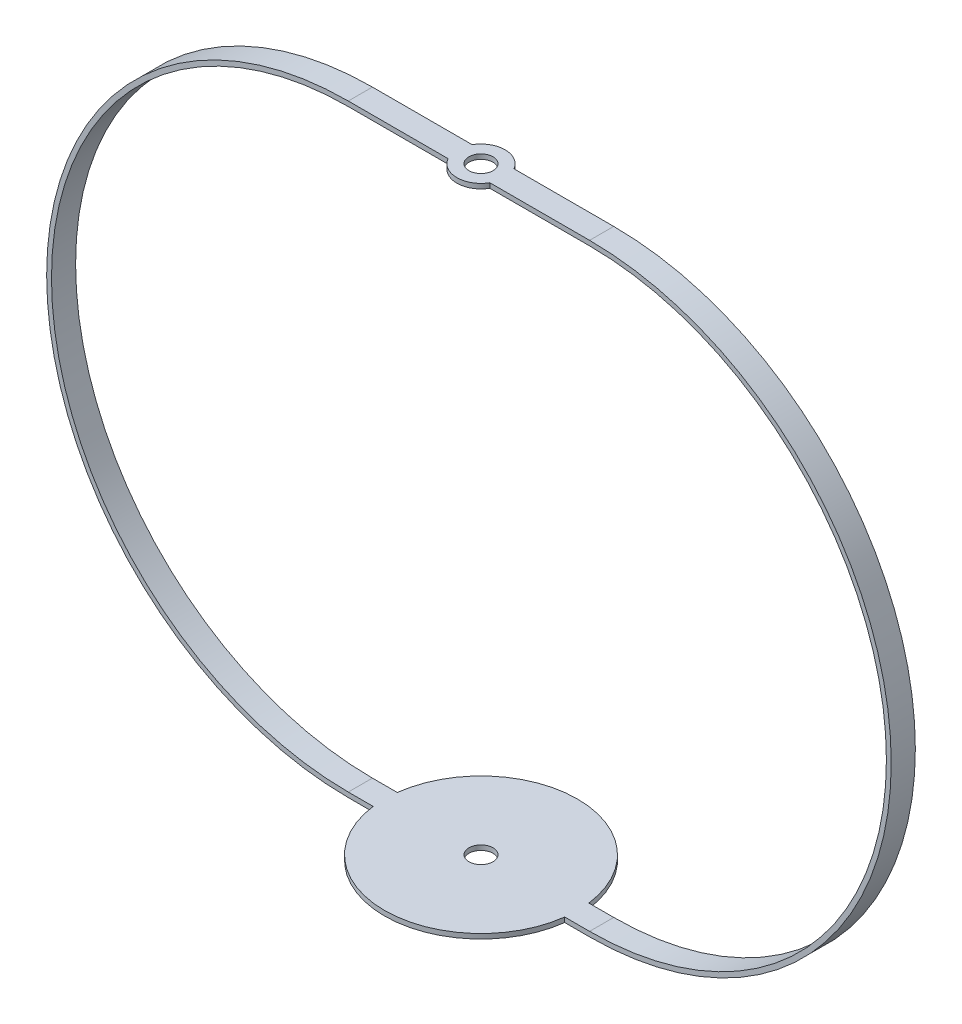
from build123d import *

# Parameters (mm, degrees)
AUFSATZ_LINEAR_AUSTRAGEN2_DEPTH      = 5
AUFSATZ_LINEAR_AUSTRAGEN2_DEPTH_BACK = 5
SKIZZE8_R                            = 10
AUFSATZ_LINEAR_AUSTRAGEN3_DEPTH      = 2
SKIZZE10_R                           = 40
AUFSATZ_LINEAR_AUSTRAGEN4_DEPTH      = 2
SKIZZE9_R                            = 5
SCHNITT_LINEAR_AUSTRAGEN3_DEPTH      = 336.394602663


with BuildPart() as part:
    # Skizze1 → Aufsatz-Linear austragen2 (new, two sides: drawn at the far end of the back side and taken through both)
    with BuildSketch(Plane.XY.offset(-AUFSATZ_LINEAR_AUSTRAGEN2_DEPTH_BACK)):
        with BuildLine():
            Line((-5.023775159, 250), (94.976224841, 250))
            ThreePointArc((94.976224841, 250), (219.976224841, 125), (94.976224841, 0))
            Line((94.976224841, 0), (-5.023775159, 0))
            ThreePointArc((-5.023775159, 0), (-130.023775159, 125), (-5.023775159, 250))
        make_face()
        with BuildLine():
            Line((94.976224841, 248), (-5.023775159, 248))
            ThreePointArc((-5.023775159, 248), (-128.023775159, 125), (-5.023775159, 2))
            Line((-5.023775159, 2), (94.976224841, 2))
            ThreePointArc((94.976224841, 2), (217.976224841, 125), (94.976224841, 248))
        make_face(mode=Mode.SUBTRACT)
    extrude(amount=AUFSATZ_LINEAR_AUSTRAGEN2_DEPTH + AUFSATZ_LINEAR_AUSTRAGEN2_DEPTH_BACK)

    # Skizze8 → Aufsatz-Linear austragen3 (add)
    with BuildSketch(Plane(origin=(0, 250, 0), x_dir=(1, 0, 0), z_dir=(0, 1, 0))):
        with Locations((44.976224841, 0)):
            Circle(SKIZZE8_R)
    extrude(amount=-AUFSATZ_LINEAR_AUSTRAGEN3_DEPTH)

    # Skizze10 → Aufsatz-Linear austragen4 (add)
    with BuildSketch(Plane(origin=(0, 2, 0), x_dir=(1, 0, 0), z_dir=(0, 1, 0))):
        with Locations((44.976224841, 0)):
            Circle(SKIZZE10_R)
    extrude(amount=-AUFSATZ_LINEAR_AUSTRAGEN4_DEPTH)

    # Skizze9 → Schnitt-Linear austragen3 (cut, through all)
    with BuildSketch(Plane(origin=(0, 250, 0), x_dir=(1, 0, 0), z_dir=(0, 1, 0))):
        with Locations(Location((44.976224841, 0, 0), (0, 0, 270))):
            Circle(SKIZZE9_R)
    extrude(amount=-SCHNITT_LINEAR_AUSTRAGEN3_DEPTH, mode=Mode.SUBTRACT)


solid = part.part
